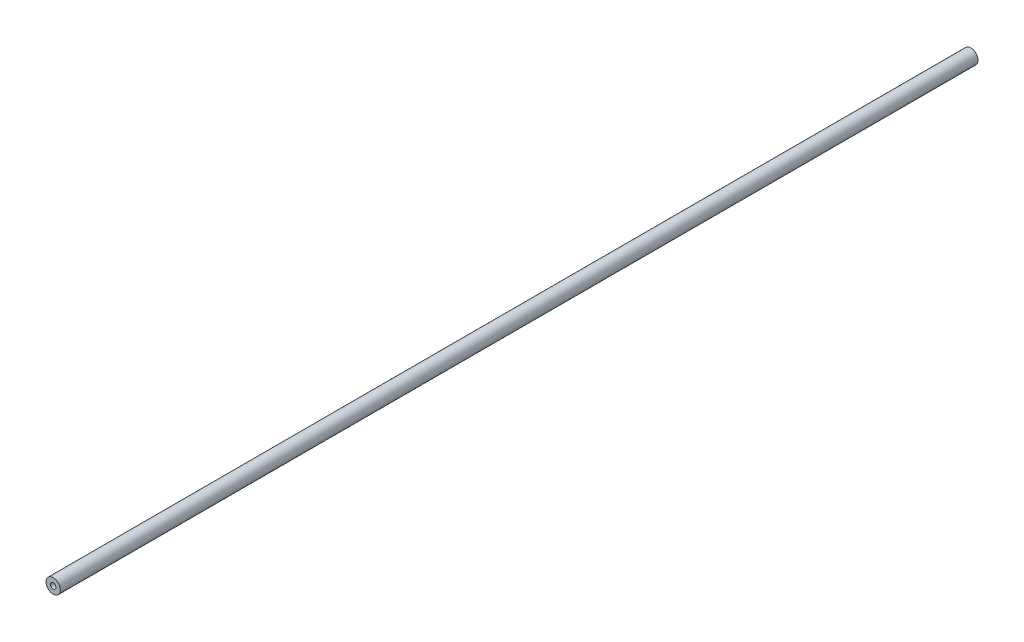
from build123d import *

# Parameters (mm, degrees)
SKETCH1_R           = 4.7625
SKETCH1_R_2         = 1.8415
BOSS_EXTRUDE1_DEPTH = 609.6


with BuildPart() as part:
    # Sketch1 → Boss-Extrude1 (new body)
    with BuildSketch(Plane.XY):
        with Locations(Location((0, 0, 0), (0, 0, 180))):
            Circle(SKETCH1_R)
        with Locations(Location((0, 0, 0), (0, 0, 180))):
            Circle(SKETCH1_R_2, mode=Mode.SUBTRACT)
    extrude(amount=BOSS_EXTRUDE1_DEPTH)


solid = part.part
